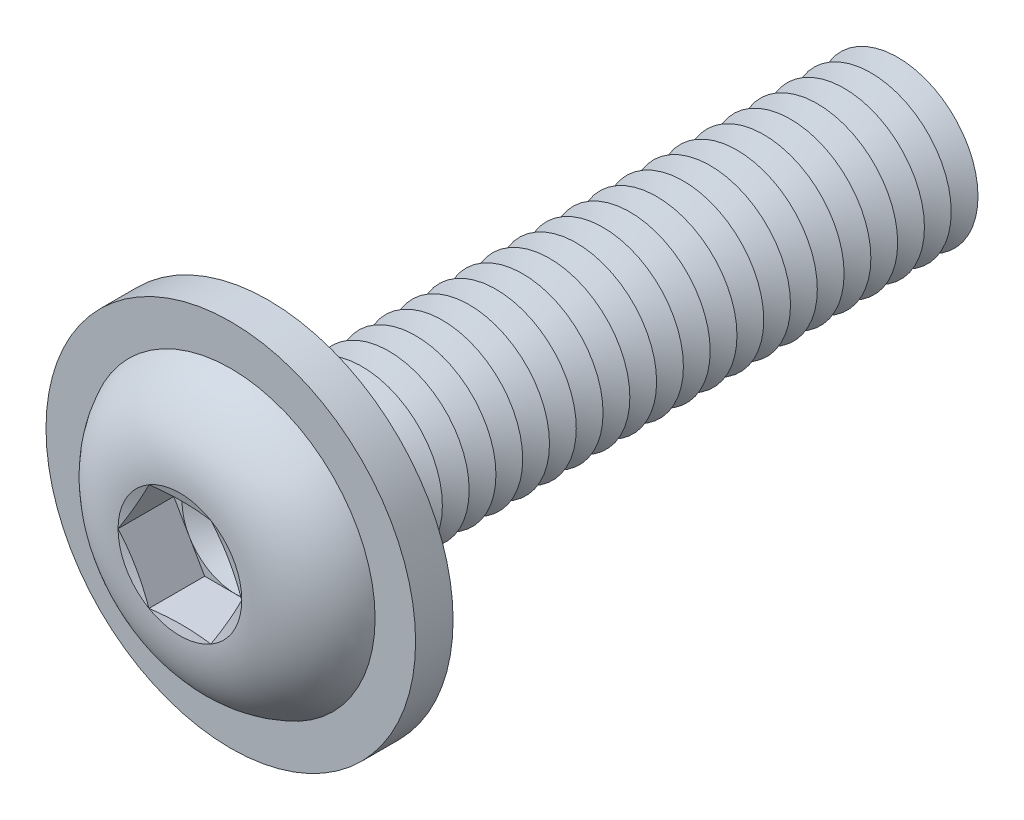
from build123d import *

# Parameters (mm, degrees)
FILLET1_R           = 0.25
LPATTERN1_COUNT     = 24
LPATTERN1_PITCH     = 0.5
CUT_EXTRUDE1_DEPTH  = 1.04
SKETCH5_R           = 3.45
SKETCH5_R_2         = 1.75
BOSS_EXTRUDE1_DEPTH = 0.7


with BuildPart() as part:
    # Sketch1 → Revolve1 (revolve)
    with BuildSketch(Plane(origin=(0, 0, 0), x_dir=(0, 0, -1), z_dir=(1, 0, 0)), mode=Mode.PRIVATE) as revolve1_sk:
        with BuildLine():
            Line((0, 1.5), (0, 2.85))
            ThreePointArc((0, 2.85), (-1.182850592, 2.35063849), (-1.65, 1.1547))
            Line((-1.65, 1.1547), (-1.495299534, 0.57735))
            Line((-1.495299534, 0.57735), (-1.65, 0.57735))
            Line((-1.65, 0.57735), (-1.65, 0))
            Line((-1.65, 0), (12, 0))
            Line((12, 0), (12, 1.5))
            Line((12, 1.5), (0, 1.5))
        make_face()
    revolve(revolve1_sk.sketch.rotate(Axis((0, 0, -12), (0, 0, 1)), 90), axis=Axis((0, 0, -12), (0, 0, 1)))

    # Fillet1
    fillet1_edges = [part.edges().sort_by_distance(p)[0] for p in [
        (1.5, 0, 0),
    ]]
    fillet(fillet1_edges, radius=FILLET1_R)

    # Sketch2 → Cut-Revolve1 (revolve, cut)
    with BuildSketch(Plane(origin=(0, 0, 0), x_dir=(0, 0, -1), z_dir=(1, 0, 0)), mode=Mode.PRIVATE) as cut_revolve1_sk:
        Polygon((11.75, 1.5), (12.25, 1.5), (12, 1.066987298), align=None)
    cut_revolve1 = revolve(cut_revolve1_sk.sketch.rotate(Axis((0, 0, -12), (0, 0, -1)), 270), axis=Axis((0, 0, -12), (0, 0, -1)), mode=Mode.SUBTRACT)

    # LPattern1: Cut-Revolve1 ×24
    with Locations(*[(0, 0, i * LPATTERN1_PITCH) for i in range(1, LPATTERN1_COUNT)]):
        add(cut_revolve1, mode=Mode.SUBTRACT)

    # Sketch3 → Cut-Extrude1 (cut)
    with BuildSketch(Plane.XY.offset(1.65)):
        Polygon((0.57735, 0.999999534), (-0.57735, 0.999999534), (-1.1547, 0), (-0.57735, -0.999999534), (0.57735, -0.999999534), (1.1547, 0), align=None)
    extrude(amount=-CUT_EXTRUDE1_DEPTH, mode=Mode.SUBTRACT)

    # Cut-Extrude2 cone 1 section (on through the dimple's axis) → Cut-Extrude2 (revolve, cut)
    with BuildSketch(Plane(origin=(0, 0, 0.61), x_dir=(0, -1, 0), z_dir=(1, 0, 0))):
        Polygon((0, 0), (0.999999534, 0), (0, 0.57735), align=None)
    revolve(axis=Axis((0, 0, 0.61), (0, 0, -1)), mode=Mode.SUBTRACT)

    # Sketch5 → Boss-Extrude1 (add)
    with BuildSketch(Plane(origin=(0, 0, 0), x_dir=(-1, 0, 0), z_dir=(0, 0, -1))):
        with Locations(Location((0, 0, 0), (0, 0, 90))):
            Circle(SKETCH5_R)
        Circle(SKETCH5_R_2, mode=Mode.SUBTRACT)
    extrude(amount=-BOSS_EXTRUDE1_DEPTH)


solid = part.part
